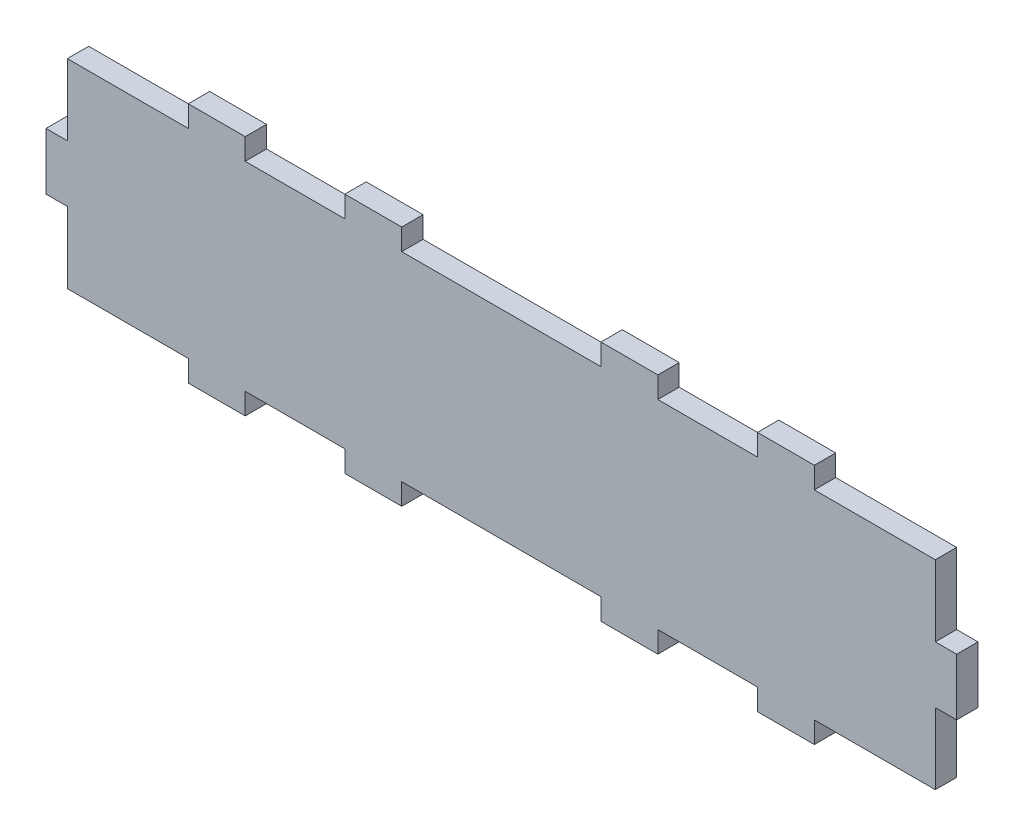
from build123d import *

# Parameters (mm, degrees)
CROQUIS1_W              = 610
CROQUIS1_H              = 140
SALIENTE_EXTRUIR1_DEPTH = 15
CROQUIS2_W              = 40
CROQUIS2_H              = 15
SALIENTE_EXTRUIR2_DEPTH = 15
CROQUIS3_W              = 15
CROQUIS3_H              = 40
SALIENTE_EXTRUIR3_DEPTH = 15
SALIENTE_EXTRUIR4_START = 610
CROQUIS3_2_W            = 15
CROQUIS3_2_H            = 40
SALIENTE_EXTRUIR4_DEPTH = 15
SALIENTE_EXTRUIR5_START = 140
CROQUIS2_2_W            = 40
CROQUIS2_2_H            = 15
SALIENTE_EXTRUIR5_DEPTH = 15


with BuildPart() as part:
    # Croquis1 → Saliente-Extruir1 (new body)
    with BuildSketch(Plane.XY):
        with Locations((305, 70)):
            Rectangle(CROQUIS1_W, CROQUIS1_H)
    extrude(amount=SALIENTE_EXTRUIR1_DEPTH)

    # Croquis2 → Saliente-Extruir2 (add)
    with BuildSketch(Plane(origin=(0, 0, 0), x_dir=(1, 0, 0), z_dir=(0, 1, 0))):
        with Locations((395, -7.5)):
            Rectangle(CROQUIS2_W, CROQUIS2_H)
        with Locations((505, -7.5)):
            Rectangle(CROQUIS2_W, CROQUIS2_H)
        with Locations((215, -7.5)):
            Rectangle(CROQUIS2_W, CROQUIS2_H)
        with Locations((105, -7.5)):
            Rectangle(CROQUIS2_W, CROQUIS2_H)
    extrude(amount=-SALIENTE_EXTRUIR2_DEPTH)

    # Croquis3 → Saliente-Extruir3 (add)
    with BuildSketch(Plane(origin=(0, 0, 0), x_dir=(0, 0, -1), z_dir=(1, 0, 0))):
        with Locations((-7.5, 70)):
            Rectangle(CROQUIS3_W, CROQUIS3_H)
    extrude(amount=-SALIENTE_EXTRUIR3_DEPTH)

    # Croquis3_2 → Saliente-Extruir4 (add)
    with BuildSketch(Plane(origin=(0, 0, 0), x_dir=(0, 0, -1), z_dir=(1, 0, 0)).offset(SALIENTE_EXTRUIR4_START)):
        with Locations((-7.5, 70)):
            Rectangle(CROQUIS3_2_W, CROQUIS3_2_H)
    extrude(amount=SALIENTE_EXTRUIR4_DEPTH)

    # Croquis2_2 → Saliente-Extruir5 (add)
    with BuildSketch(Plane(origin=(0, 0, 0), x_dir=(1, 0, 0), z_dir=(0, 1, 0)).offset(SALIENTE_EXTRUIR5_START)):
        with Locations((395, -7.5)):
            Rectangle(CROQUIS2_2_W, CROQUIS2_2_H)
        with Locations((505, -7.5)):
            Rectangle(CROQUIS2_2_W, CROQUIS2_2_H)
        with Locations((215, -7.5)):
            Rectangle(CROQUIS2_2_W, CROQUIS2_2_H)
        with Locations((105, -7.5)):
            Rectangle(CROQUIS2_2_W, CROQUIS2_2_H)
    extrude(amount=SALIENTE_EXTRUIR5_DEPTH)


solid = part.part
